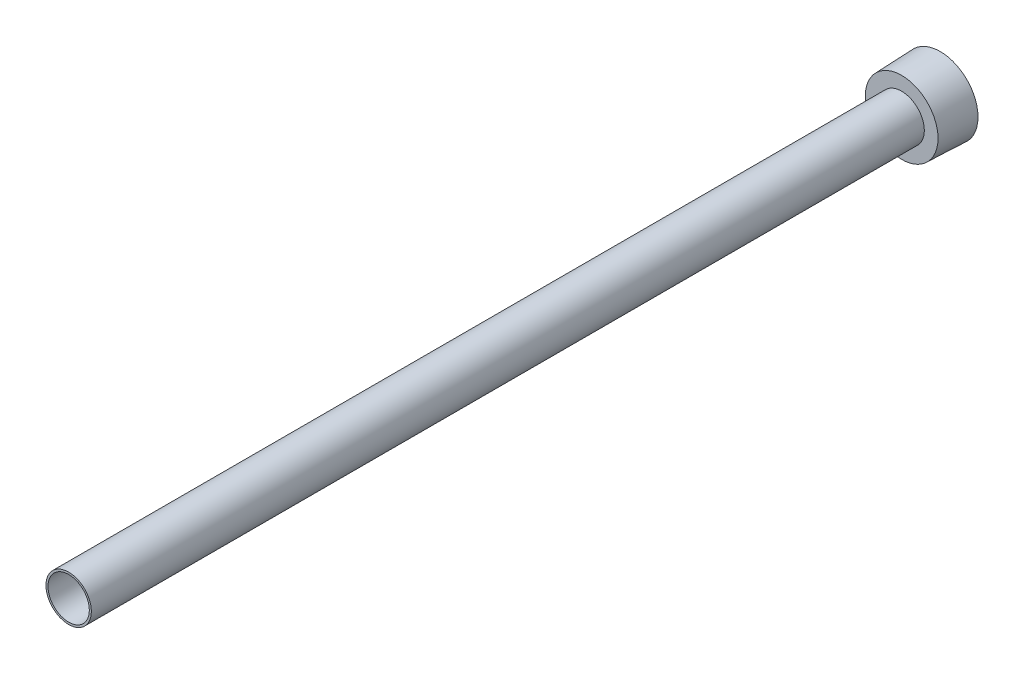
ISO-10303-21;
HEADER;
FILE_DESCRIPTION(('STEP AP214'),'2;1');
FILE_NAME('part.step','',(''),(''),'','','');
FILE_SCHEMA(('AUTOMOTIVE_DESIGN { 1 0 10303 214 1 1 1 1 }'));
ENDSEC;
DATA;
#1=APPLICATION_CONTEXT('core data for automotive mechanical design processes');
#2=APPLICATION_PROTOCOL_DEFINITION('international standard','automotive_design',2000,#1);
#3=PRODUCT_CONTEXT('',#1,'mechanical');
#4=PRODUCT('Part','Part','',(#3));
#5=PRODUCT_RELATED_PRODUCT_CATEGORY('part','',(#4));
#6=PRODUCT_DEFINITION_FORMATION('','',#4);
#7=PRODUCT_DEFINITION_CONTEXT('part definition',#1,'design');
#8=PRODUCT_DEFINITION('design','',#6,#7);
#9=PRODUCT_DEFINITION_SHAPE('','',#8);
#10=(LENGTH_UNIT() NAMED_UNIT(*) SI_UNIT(.MILLI.,.METRE.));
#11=(NAMED_UNIT(*) PLANE_ANGLE_UNIT() SI_UNIT($,.RADIAN.));
#12=(NAMED_UNIT(*) SI_UNIT($,.STERADIAN.) SOLID_ANGLE_UNIT());
#13=UNCERTAINTY_MEASURE_WITH_UNIT(LENGTH_MEASURE(1.E-05),#10,'distance_accuracy_value','');
#14=(GEOMETRIC_REPRESENTATION_CONTEXT(3) GLOBAL_UNCERTAINTY_ASSIGNED_CONTEXT((#13)) GLOBAL_UNIT_ASSIGNED_CONTEXT((#10,
#11,#12)) REPRESENTATION_CONTEXT('',''));
#15=CARTESIAN_POINT('',(0.,0.,0.));
#16=DIRECTION('',(0.,0.,1.));
#17=DIRECTION('',(1.,0.,0.));
#18=AXIS2_PLACEMENT_3D('',#15,#16,#17);
#19=CARTESIAN_POINT('',(0.,0.,0.));
#20=DIRECTION('',(0.,0.,1.));
#21=DIRECTION('',(1.,0.,0.));
#22=AXIS2_PLACEMENT_3D('',#19,#20,#21);
#23=CYLINDRICAL_SURFACE('',#22,7.2263);
#24=CARTESIAN_POINT('',(0.,0.,304.8));
#25=DIRECTION('',(0.,0.,1.));
#26=DIRECTION('',(1.,0.,0.));
#27=AXIS2_PLACEMENT_3D('',#24,#25,#26);
#28=CIRCLE('',#27,7.2263);
#29=CARTESIAN_POINT('',(7.2263,0.,304.8));
#30=VERTEX_POINT('',#29);
#31=EDGE_CURVE('E142',#30,#30,#28,.T.);
#32=ORIENTED_EDGE('',*,*,#31,.T.);
#33=EDGE_LOOP('',(#32));
#34=FACE_BOUND('',#33,.T.);
#35=CARTESIAN_POINT('',(0.,0.,9.525));
#36=DIRECTION('',(0.,0.,-1.));
#37=DIRECTION('',(-1.,0.,0.));
#38=AXIS2_PLACEMENT_3D('',#35,#36,#37);
#39=CIRCLE('',#38,7.2263);
#40=CARTESIAN_POINT('',(-7.2263,0.,9.525));
#41=VERTEX_POINT('',#40);
#42=EDGE_CURVE('E37',#41,#41,#39,.F.);
#43=ORIENTED_EDGE('',*,*,#42,.F.);
#44=EDGE_LOOP('',(#43));
#45=FACE_BOUND('',#44,.T.);
#46=ADVANCED_FACE('F33',(#34,#45),#23,.F.);
#47=CARTESIAN_POINT('',(0.,7.93749999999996,304.8));
#48=DIRECTION('',(0.,0.,-1.));
#49=DIRECTION('',(-1.,0.,0.));
#50=AXIS2_PLACEMENT_3D('',#47,#48,#49);
#51=PLANE('',#50);
#52=ORIENTED_EDGE('',*,*,#31,.F.);
#53=EDGE_LOOP('',(#52));
#54=FACE_BOUND('',#53,.T.);
#55=CARTESIAN_POINT('',(0.,0.,304.8));
#56=DIRECTION('',(0.,0.,1.));
#57=DIRECTION('',(1.,0.,0.));
#58=AXIS2_PLACEMENT_3D('',#55,#56,#57);
#59=CIRCLE('',#58,7.93749999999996);
#60=CARTESIAN_POINT('',(7.93749999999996,0.,304.8));
#61=VERTEX_POINT('',#60);
#62=EDGE_CURVE('E145',#61,#61,#59,.T.);
#63=ORIENTED_EDGE('',*,*,#62,.T.);
#64=EDGE_LOOP('',(#63));
#65=FACE_BOUND('',#64,.T.);
#66=ADVANCED_FACE('F35',(#54,#65),#51,.F.);
#67=CARTESIAN_POINT('',(0.,0.,0.));
#68=DIRECTION('',(0.,0.,1.));
#69=DIRECTION('',(1.,0.,0.));
#70=AXIS2_PLACEMENT_3D('',#67,#68,#69);
#71=PLANE('',#70);
#72=DIRECTION('',(-0.866025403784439,-0.5,0.));
#73=VECTOR('',#72,1.);
#74=CARTESIAN_POINT('',(9.525,-5.49926131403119,0.));
#75=LINE('',#74,#73);
#76=CARTESIAN_POINT('',(9.525,-5.49926131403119,0.));
#77=VERTEX_POINT('',#76);
#78=CARTESIAN_POINT('',(0.,-10.9985226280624,0.));
#79=VERTEX_POINT('',#78);
#80=EDGE_CURVE('E124',#77,#79,#75,.T.);
#81=ORIENTED_EDGE('',*,*,#80,.F.);
#82=DIRECTION('',(0.,-1.,0.));
#83=VECTOR('',#82,1.);
#84=CARTESIAN_POINT('',(9.525,5.49926131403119,0.));
#85=LINE('',#84,#83);
#86=CARTESIAN_POINT('',(9.525,5.49926131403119,0.));
#87=VERTEX_POINT('',#86);
#88=EDGE_CURVE('E49',#87,#77,#85,.T.);
#89=ORIENTED_EDGE('',*,*,#88,.F.);
#90=DIRECTION('',(0.866025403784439,-0.5,0.));
#91=VECTOR('',#90,1.);
#92=CARTESIAN_POINT('',(0.,10.9985226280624,0.));
#93=LINE('',#92,#91);
#94=CARTESIAN_POINT('',(0.,10.9985226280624,0.));
#95=VERTEX_POINT('',#94);
#96=EDGE_CURVE('E133',#95,#87,#93,.T.);
#97=ORIENTED_EDGE('',*,*,#96,.F.);
#98=DIRECTION('',(0.866025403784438,0.5,0.));
#99=VECTOR('',#98,1.);
#100=CARTESIAN_POINT('',(-9.525,5.49926131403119,0.));
#101=LINE('',#100,#99);
#102=CARTESIAN_POINT('',(-9.525,5.49926131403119,0.));
#103=VERTEX_POINT('',#102);
#104=EDGE_CURVE('E131',#103,#95,#101,.T.);
#105=ORIENTED_EDGE('',*,*,#104,.F.);
#106=DIRECTION('',(0.,1.,0.));
#107=VECTOR('',#106,1.);
#108=CARTESIAN_POINT('',(-9.525,-5.49926131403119,0.));
#109=LINE('',#108,#107);
#110=CARTESIAN_POINT('',(-9.525,-5.49926131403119,0.));
#111=VERTEX_POINT('',#110);
#112=EDGE_CURVE('E97',#111,#103,#109,.T.);
#113=ORIENTED_EDGE('',*,*,#112,.F.);
#114=DIRECTION('',(-0.866025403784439,0.5,0.));
#115=VECTOR('',#114,1.);
#116=CARTESIAN_POINT('',(0.,-10.9985226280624,0.));
#117=LINE('',#116,#115);
#118=EDGE_CURVE('E127',#79,#111,#117,.T.);
#119=ORIENTED_EDGE('',*,*,#118,.F.);
#120=EDGE_LOOP('',(#81,#89,#97,#105,#113,#119));
#121=FACE_BOUND('',#120,.T.);
#122=CARTESIAN_POINT('',(0.,0.,0.));
#123=DIRECTION('',(0.,0.,1.));
#124=DIRECTION('',(1.,0.,0.));
#125=AXIS2_PLACEMENT_3D('',#122,#123,#124);
#126=CIRCLE('',#125,13.2207);
#127=CARTESIAN_POINT('',(13.2207,0.,0.));
#128=VERTEX_POINT('',#127);
#129=EDGE_CURVE('E11',#128,#128,#126,.T.);
#130=ORIENTED_EDGE('',*,*,#129,.F.);
#131=EDGE_LOOP('',(#130));
#132=FACE_BOUND('',#131,.T.);
#133=ADVANCED_FACE('F159',(#121,#132),#71,.F.);
#134=CARTESIAN_POINT('',(0.,0.,0.));
#135=DIRECTION('',(0.,0.,-1.));
#136=DIRECTION('',(-1.,0.,0.));
#137=AXIS2_PLACEMENT_3D('',#134,#135,#136);
#138=CONICAL_SURFACE('',#137,13.2207,0.0364599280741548);
#139=CARTESIAN_POINT('',(0.,0.,13.4874));
#140=DIRECTION('',(0.,0.,1.));
#141=DIRECTION('',(1.,0.,0.));
#142=AXIS2_PLACEMENT_3D('',#139,#140,#141);
#143=CIRCLE('',#142,12.7287323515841);
#144=CARTESIAN_POINT('',(12.7287323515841,0.,13.4874));
#145=VERTEX_POINT('',#144);
#146=EDGE_CURVE('E42',#145,#145,#143,.T.);
#147=ORIENTED_EDGE('',*,*,#146,.F.);
#148=EDGE_LOOP('',(#147));
#149=FACE_BOUND('',#148,.T.);
#150=ORIENTED_EDGE('',*,*,#129,.T.);
#151=EDGE_LOOP('',(#150));
#152=FACE_BOUND('',#151,.T.);
#153=ADVANCED_FACE('F156',(#149,#152),#138,.T.);
#154=CARTESIAN_POINT('',(0.,12.7287323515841,13.4874));
#155=DIRECTION('',(0.,0.,-1.));
#156=DIRECTION('',(-1.,0.,0.));
#157=AXIS2_PLACEMENT_3D('',#154,#155,#156);
#158=PLANE('',#157);
#159=CARTESIAN_POINT('',(0.,0.,13.4874));
#160=DIRECTION('',(0.,0.,1.));
#161=DIRECTION('',(1.,0.,0.));
#162=AXIS2_PLACEMENT_3D('',#159,#160,#161);
#163=CIRCLE('',#162,7.9375);
#164=CARTESIAN_POINT('',(7.9375,0.,13.4874));
#165=VERTEX_POINT('',#164);
#166=EDGE_CURVE('E148',#165,#165,#163,.T.);
#167=ORIENTED_EDGE('',*,*,#166,.F.);
#168=EDGE_LOOP('',(#167));
#169=FACE_BOUND('',#168,.T.);
#170=ORIENTED_EDGE('',*,*,#146,.T.);
#171=EDGE_LOOP('',(#170));
#172=FACE_BOUND('',#171,.T.);
#173=ADVANCED_FACE('F154',(#169,#172),#158,.F.);
#174=CARTESIAN_POINT('',(0.,0.,278.00111462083));
#175=DIRECTION('',(0.,0.,1.));
#176=DIRECTION('',(1.,0.,0.));
#177=AXIS2_PLACEMENT_3D('',#174,#175,#176);
#178=CYLINDRICAL_SURFACE('',#177,7.93749999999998);
#179=ORIENTED_EDGE('',*,*,#62,.F.);
#180=EDGE_LOOP('',(#179));
#181=FACE_BOUND('',#180,.T.);
#182=ORIENTED_EDGE('',*,*,#166,.T.);
#183=EDGE_LOOP('',(#182));
#184=FACE_BOUND('',#183,.T.);
#185=ADVANCED_FACE('F180',(#181,#184),#178,.T.);
#186=CARTESIAN_POINT('',(9.525,-5.49926131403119,9.525));
#187=DIRECTION('',(0.,0.,-1.));
#188=DIRECTION('',(-1.,0.,0.));
#189=AXIS2_PLACEMENT_3D('',#186,#187,#188);
#190=PLANE('',#189);
#191=DIRECTION('',(0.,-1.,0.));
#192=VECTOR('',#191,1.);
#193=CARTESIAN_POINT('',(9.525,5.49926131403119,9.525));
#194=LINE('',#193,#192);
#195=CARTESIAN_POINT('',(9.525,5.49926131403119,9.525));
#196=VERTEX_POINT('',#195);
#197=CARTESIAN_POINT('',(9.525,-5.49926131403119,9.525));
#198=VERTEX_POINT('',#197);
#199=EDGE_CURVE('E135',#196,#198,#194,.T.);
#200=ORIENTED_EDGE('',*,*,#199,.T.);
#201=DIRECTION('',(-0.866025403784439,-0.5,0.));
#202=VECTOR('',#201,1.);
#203=CARTESIAN_POINT('',(9.525,-5.49926131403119,9.525));
#204=LINE('',#203,#202);
#205=CARTESIAN_POINT('',(0.,-10.9985226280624,9.525));
#206=VERTEX_POINT('',#205);
#207=EDGE_CURVE('E118',#198,#206,#204,.T.);
#208=ORIENTED_EDGE('',*,*,#207,.T.);
#209=DIRECTION('',(-0.866025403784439,0.5,0.));
#210=VECTOR('',#209,1.);
#211=CARTESIAN_POINT('',(0.,-10.9985226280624,9.525));
#212=LINE('',#211,#210);
#213=CARTESIAN_POINT('',(-9.525,-5.49926131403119,9.525));
#214=VERTEX_POINT('',#213);
#215=EDGE_CURVE('E116',#206,#214,#212,.T.);
#216=ORIENTED_EDGE('',*,*,#215,.T.);
#217=DIRECTION('',(0.,1.,0.));
#218=VECTOR('',#217,1.);
#219=CARTESIAN_POINT('',(-9.525,-5.49926131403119,9.525));
#220=LINE('',#219,#218);
#221=CARTESIAN_POINT('',(-9.525,5.49926131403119,9.525));
#222=VERTEX_POINT('',#221);
#223=EDGE_CURVE('E94',#214,#222,#220,.T.);
#224=ORIENTED_EDGE('',*,*,#223,.T.);
#225=DIRECTION('',(0.866025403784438,0.5,0.));
#226=VECTOR('',#225,1.);
#227=CARTESIAN_POINT('',(-9.525,5.49926131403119,9.525));
#228=LINE('',#227,#226);
#229=CARTESIAN_POINT('',(0.,10.9985226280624,9.525));
#230=VERTEX_POINT('',#229);
#231=EDGE_CURVE('E105',#222,#230,#228,.T.);
#232=ORIENTED_EDGE('',*,*,#231,.T.);
#233=DIRECTION('',(0.866025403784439,-0.5,0.));
#234=VECTOR('',#233,1.);
#235=CARTESIAN_POINT('',(0.,10.9985226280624,9.525));
#236=LINE('',#235,#234);
#237=EDGE_CURVE('E109',#230,#196,#236,.T.);
#238=ORIENTED_EDGE('',*,*,#237,.T.);
#239=EDGE_LOOP('',(#200,#208,#216,#224,#232,#238));
#240=FACE_BOUND('',#239,.T.);
#241=ORIENTED_EDGE('',*,*,#42,.T.);
#242=EDGE_LOOP('',(#241));
#243=FACE_BOUND('',#242,.T.);
#244=ADVANCED_FACE('F112',(#240,#243),#190,.T.);
#245=CARTESIAN_POINT('',(9.525,5.49926131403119,9.525));
#246=DIRECTION('',(1.,0.,0.));
#247=DIRECTION('',(0.,1.,0.));
#248=AXIS2_PLACEMENT_3D('',#245,#246,#247);
#249=PLANE('',#248);
#250=ORIENTED_EDGE('',*,*,#88,.T.);
#251=DIRECTION('',(0.,0.,-1.));
#252=VECTOR('',#251,1.);
#253=CARTESIAN_POINT('',(9.525,-5.49926131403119,9.525));
#254=LINE('',#253,#252);
#255=EDGE_CURVE('E79',#198,#77,#254,.T.);
#256=ORIENTED_EDGE('',*,*,#255,.F.);
#257=ORIENTED_EDGE('',*,*,#199,.F.);
#258=DIRECTION('',(0.,0.,-1.));
#259=VECTOR('',#258,1.);
#260=CARTESIAN_POINT('',(9.525,5.49926131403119,9.525));
#261=LINE('',#260,#259);
#262=EDGE_CURVE('E57',#196,#87,#261,.T.);
#263=ORIENTED_EDGE('',*,*,#262,.T.);
#264=EDGE_LOOP('',(#250,#256,#257,#263));
#265=FACE_BOUND('',#264,.T.);
#266=ADVANCED_FACE('F178',(#265),#249,.F.);
#267=CARTESIAN_POINT('',(0.,10.9985226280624,9.525));
#268=DIRECTION('',(0.5,0.866025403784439,0.));
#269=DIRECTION('',(-0.866025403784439,0.5,0.));
#270=AXIS2_PLACEMENT_3D('',#267,#268,#269);
#271=PLANE('',#270);
#272=ORIENTED_EDGE('',*,*,#96,.T.);
#273=ORIENTED_EDGE('',*,*,#262,.F.);
#274=ORIENTED_EDGE('',*,*,#237,.F.);
#275=DIRECTION('',(0.,0.,-1.));
#276=VECTOR('',#275,1.);
#277=CARTESIAN_POINT('',(0.,10.9985226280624,9.525));
#278=LINE('',#277,#276);
#279=EDGE_CURVE('E101',#230,#95,#278,.T.);
#280=ORIENTED_EDGE('',*,*,#279,.T.);
#281=EDGE_LOOP('',(#272,#273,#274,#280));
#282=FACE_BOUND('',#281,.T.);
#283=ADVANCED_FACE('F209',(#282),#271,.F.);
#284=CARTESIAN_POINT('',(-9.525,5.49926131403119,9.525));
#285=DIRECTION('',(-0.5,0.866025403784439,0.));
#286=DIRECTION('',(-0.866025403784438,-0.5,0.));
#287=AXIS2_PLACEMENT_3D('',#284,#285,#286);
#288=PLANE('',#287);
#289=ORIENTED_EDGE('',*,*,#104,.T.);
#290=ORIENTED_EDGE('',*,*,#279,.F.);
#291=ORIENTED_EDGE('',*,*,#231,.F.);
#292=DIRECTION('',(0.,0.,-1.));
#293=VECTOR('',#292,1.);
#294=CARTESIAN_POINT('',(-9.525,5.49926131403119,9.525));
#295=LINE('',#294,#293);
#296=EDGE_CURVE('E90',#222,#103,#295,.T.);
#297=ORIENTED_EDGE('',*,*,#296,.T.);
#298=EDGE_LOOP('',(#289,#290,#291,#297));
#299=FACE_BOUND('',#298,.T.);
#300=ADVANCED_FACE('F106',(#299),#288,.F.);
#301=CARTESIAN_POINT('',(-9.525,-5.49926131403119,9.525));
#302=DIRECTION('',(-1.,0.,0.));
#303=DIRECTION('',(0.,-1.,0.));
#304=AXIS2_PLACEMENT_3D('',#301,#302,#303);
#305=PLANE('',#304);
#306=ORIENTED_EDGE('',*,*,#112,.T.);
#307=ORIENTED_EDGE('',*,*,#296,.F.);
#308=ORIENTED_EDGE('',*,*,#223,.F.);
#309=DIRECTION('',(0.,0.,-1.));
#310=VECTOR('',#309,1.);
#311=CARTESIAN_POINT('',(-9.525,-5.49926131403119,9.525));
#312=LINE('',#311,#310);
#313=EDGE_CURVE('E102',#214,#111,#312,.T.);
#314=ORIENTED_EDGE('',*,*,#313,.T.);
#315=EDGE_LOOP('',(#306,#307,#308,#314));
#316=FACE_BOUND('',#315,.T.);
#317=ADVANCED_FACE('F92',(#316),#305,.F.);
#318=CARTESIAN_POINT('',(0.,-10.9985226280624,9.525));
#319=DIRECTION('',(-0.5,-0.866025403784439,0.));
#320=DIRECTION('',(0.866025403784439,-0.5,0.));
#321=AXIS2_PLACEMENT_3D('',#318,#319,#320);
#322=PLANE('',#321);
#323=ORIENTED_EDGE('',*,*,#118,.T.);
#324=ORIENTED_EDGE('',*,*,#313,.F.);
#325=ORIENTED_EDGE('',*,*,#215,.F.);
#326=DIRECTION('',(0.,0.,-1.));
#327=VECTOR('',#326,1.);
#328=CARTESIAN_POINT('',(0.,-10.9985226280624,9.525));
#329=LINE('',#328,#327);
#330=EDGE_CURVE('E139',#206,#79,#329,.T.);
#331=ORIENTED_EDGE('',*,*,#330,.T.);
#332=EDGE_LOOP('',(#323,#324,#325,#331));
#333=FACE_BOUND('',#332,.T.);
#334=ADVANCED_FACE('F227',(#333),#322,.F.);
#335=CARTESIAN_POINT('',(9.525,-5.49926131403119,9.525));
#336=DIRECTION('',(0.5,-0.866025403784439,0.));
#337=DIRECTION('',(0.866025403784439,0.5,0.));
#338=AXIS2_PLACEMENT_3D('',#335,#336,#337);
#339=PLANE('',#338);
#340=ORIENTED_EDGE('',*,*,#80,.T.);
#341=ORIENTED_EDGE('',*,*,#330,.F.);
#342=ORIENTED_EDGE('',*,*,#207,.F.);
#343=ORIENTED_EDGE('',*,*,#255,.T.);
#344=EDGE_LOOP('',(#340,#341,#342,#343));
#345=FACE_BOUND('',#344,.T.);
#346=ADVANCED_FACE('F234',(#345),#339,.F.);
#347=CLOSED_SHELL('',(#46,#66,#133,#153,#173,#185,#244,#266,#283,#300,#317,#334,#346));
#348=MANIFOLD_SOLID_BREP('B2',#347);
#349=ADVANCED_BREP_SHAPE_REPRESENTATION('',(#18,#348),#14);
#350=SHAPE_DEFINITION_REPRESENTATION(#9,#349);
ENDSEC;
END-ISO-10303-21;
